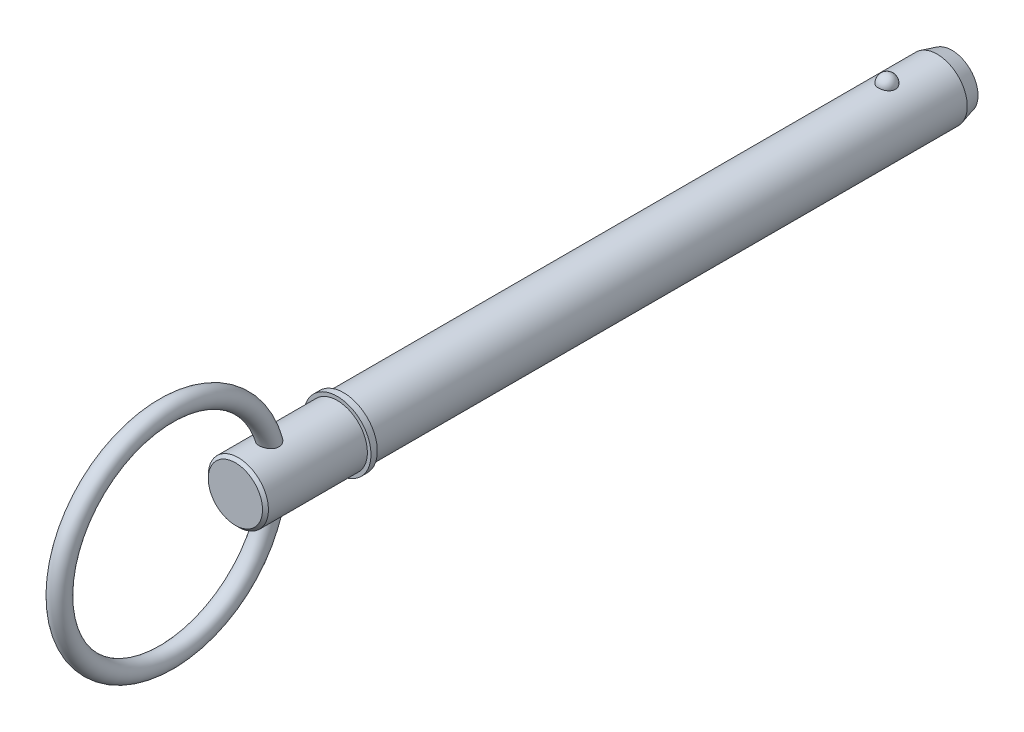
ISO-10303-21;
HEADER;
FILE_DESCRIPTION(('STEP AP214'),'2;1');
FILE_NAME('part.step','',(''),(''),'','','');
FILE_SCHEMA(('AUTOMOTIVE_DESIGN { 1 0 10303 214 1 1 1 1 }'));
ENDSEC;
DATA;
#1=APPLICATION_CONTEXT('core data for automotive mechanical design processes');
#2=APPLICATION_PROTOCOL_DEFINITION('international standard','automotive_design',2000,#1);
#3=PRODUCT_CONTEXT('',#1,'mechanical');
#4=PRODUCT('Part','Part','',(#3));
#5=PRODUCT_RELATED_PRODUCT_CATEGORY('part','',(#4));
#6=PRODUCT_DEFINITION_FORMATION('','',#4);
#7=PRODUCT_DEFINITION_CONTEXT('part definition',#1,'design');
#8=PRODUCT_DEFINITION('design','',#6,#7);
#9=PRODUCT_DEFINITION_SHAPE('','',#8);
#10=(LENGTH_UNIT() NAMED_UNIT(*) SI_UNIT(.MILLI.,.METRE.));
#11=(NAMED_UNIT(*) PLANE_ANGLE_UNIT() SI_UNIT($,.RADIAN.));
#12=(NAMED_UNIT(*) SI_UNIT($,.STERADIAN.) SOLID_ANGLE_UNIT());
#13=UNCERTAINTY_MEASURE_WITH_UNIT(LENGTH_MEASURE(1.E-05),#10,'distance_accuracy_value','');
#14=(GEOMETRIC_REPRESENTATION_CONTEXT(3) GLOBAL_UNCERTAINTY_ASSIGNED_CONTEXT((#13)) GLOBAL_UNIT_ASSIGNED_CONTEXT((#10,
#11,#12)) REPRESENTATION_CONTEXT('',''));
#15=CARTESIAN_POINT('',(0.,0.,0.));
#16=DIRECTION('',(0.,0.,1.));
#17=DIRECTION('',(1.,0.,0.));
#18=AXIS2_PLACEMENT_3D('',#15,#16,#17);
#19=CARTESIAN_POINT('',(0.,0.,127.));
#20=DIRECTION('',(0.,0.,-1.));
#21=DIRECTION('',(-1.,0.,0.));
#22=AXIS2_PLACEMENT_3D('',#19,#20,#21);
#23=CYLINDRICAL_SURFACE('',#22,7.145);
#24=CARTESIAN_POINT('',(1.99971637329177,6.85945766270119,-2.01999999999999));
#25=CARTESIAN_POINT('',(1.9997145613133,6.85945924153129,-1.90709736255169));
#26=CARTESIAN_POINT('',(1.99051486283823,6.86216053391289,-1.79417185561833));
#27=CARTESIAN_POINT('',(1.95393597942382,6.87266409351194,-1.57152267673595));
#28=CARTESIAN_POINT('',(1.92655029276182,6.88046818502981,-1.46180016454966));
#29=CARTESIAN_POINT('',(1.85429435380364,6.90029063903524,-1.24873107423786));
#30=CARTESIAN_POINT('',(1.80943177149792,6.91230715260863,-1.14538172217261));
#31=CARTESIAN_POINT('',(1.70333474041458,6.93921158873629,-0.947875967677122));
#32=CARTESIAN_POINT('',(1.64210059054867,6.95409945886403,-0.85371939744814));
#33=CARTESIAN_POINT('',(1.5044381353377,6.98517577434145,-0.676721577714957));
#34=CARTESIAN_POINT('',(1.42793505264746,7.00137037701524,-0.593939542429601));
#35=CARTESIAN_POINT('',(1.26189697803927,7.03319066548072,-0.442536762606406));
#36=CARTESIAN_POINT('',(1.17236198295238,7.04881635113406,-0.373916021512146));
#37=CARTESIAN_POINT('',(0.982932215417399,7.0777121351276,-0.252935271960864));
#38=CARTESIAN_POINT('',(0.883068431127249,7.09098897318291,-0.200528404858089));
#39=CARTESIAN_POINT('',(0.675560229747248,7.11375589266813,-0.113212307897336));
#40=CARTESIAN_POINT('',(0.567916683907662,7.12324639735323,-0.0783011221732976));
#41=CARTESIAN_POINT('',(0.350006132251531,7.13724173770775,-0.0274707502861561));
#42=CARTESIAN_POINT('',(0.239822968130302,7.14183447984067,-0.011216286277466));
#43=CARTESIAN_POINT('',(0.0181946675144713,7.14583597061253,0.00296794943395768));
#44=CARTESIAN_POINT('',(-0.0932503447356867,7.14524522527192,0.000899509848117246));
#45=CARTESIAN_POINT('',(-0.312527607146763,7.13899247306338,-0.0213331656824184));
#46=CARTESIAN_POINT('',(-0.420388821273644,7.13340426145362,-0.0412340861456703));
#47=CARTESIAN_POINT('',(-0.631141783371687,7.11785474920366,-0.0982040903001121));
#48=CARTESIAN_POINT('',(-0.734033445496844,7.10789337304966,-0.135273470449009));
#49=CARTESIAN_POINT('',(-0.932634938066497,7.08458058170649,-0.225826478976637));
#50=CARTESIAN_POINT('',(-1.02829911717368,7.07120963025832,-0.279405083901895));
#51=CARTESIAN_POINT('',(-1.20927180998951,7.04252043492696,-0.40145733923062));
#52=CARTESIAN_POINT('',(-1.29457925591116,7.02720199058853,-0.469932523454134));
#53=CARTESIAN_POINT('',(-1.45423311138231,6.995926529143,-0.6214381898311));
#54=CARTESIAN_POINT('',(-1.5283348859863,6.97996288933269,-0.704725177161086));
#55=CARTESIAN_POINT('',(-1.66169281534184,6.94942414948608,-0.882667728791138));
#56=CARTESIAN_POINT('',(-1.72094789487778,6.93484915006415,-0.977324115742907));
#57=CARTESIAN_POINT('',(-1.82375276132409,6.90853186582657,-1.17661373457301));
#58=CARTESIAN_POINT('',(-1.86711024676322,6.8968248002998,-1.28135093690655));
#59=CARTESIAN_POINT('',(-1.9360425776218,6.87779420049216,-1.49689986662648));
#60=CARTESIAN_POINT('',(-1.96161794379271,6.87047053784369,-1.60771141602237));
#61=CARTESIAN_POINT('',(-1.99427437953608,6.86106309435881,-1.83176258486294));
#62=CARTESIAN_POINT('',(-2.00143373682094,6.8589571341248,-1.94498985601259));
#63=CARTESIAN_POINT('',(-1.99730449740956,6.86016064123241,-2.17107603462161));
#64=CARTESIAN_POINT('',(-1.98601641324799,6.86346995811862,-2.28393495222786));
#65=CARTESIAN_POINT('',(-1.94538181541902,6.87509649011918,-2.50548437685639));
#66=CARTESIAN_POINT('',(-1.91612773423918,6.88338806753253,-2.61419321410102));
#67=CARTESIAN_POINT('',(-1.84036449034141,6.90402888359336,-2.82501243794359));
#68=CARTESIAN_POINT('',(-1.79385462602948,6.91637828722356,-2.92712255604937));
#69=CARTESIAN_POINT('',(-1.68442067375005,6.94384180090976,-3.12247704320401));
#70=CARTESIAN_POINT('',(-1.62140729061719,6.95897081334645,-3.21566929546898));
#71=CARTESIAN_POINT('',(-1.4806650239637,6.99026742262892,-3.38999412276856));
#72=CARTESIAN_POINT('',(-1.40293556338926,7.00643506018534,-3.47112622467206));
#73=CARTESIAN_POINT('',(-1.2344320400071,7.03807960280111,-3.61938672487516));
#74=CARTESIAN_POINT('',(-1.1436092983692,7.05355363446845,-3.68646046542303));
#75=CARTESIAN_POINT('',(-0.9515914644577,7.08201263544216,-3.80431973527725));
#76=CARTESIAN_POINT('',(-0.850397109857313,7.09499778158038,-3.85510642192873));
#77=CARTESIAN_POINT('',(-0.641823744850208,7.11687679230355,-3.93839532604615));
#78=CARTESIAN_POINT('',(-0.534539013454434,7.1258202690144,-3.97112042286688));
#79=CARTESIAN_POINT('',(-0.315743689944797,7.1388605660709,-4.01830716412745));
#80=CARTESIAN_POINT('',(-0.204233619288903,7.14295798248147,-4.03277105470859));
#81=CARTESIAN_POINT('',(0.0175518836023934,7.14582273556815,-4.04291389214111));
#82=CARTESIAN_POINT('',(0.127809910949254,7.14469090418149,-4.03894819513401));
#83=CARTESIAN_POINT('',(0.346044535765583,7.13745046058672,-4.01315850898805));
#84=CARTESIAN_POINT('',(0.454021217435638,7.13134203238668,-3.99133518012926));
#85=CARTESIAN_POINT('',(0.664227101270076,7.11483713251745,-3.93057164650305));
#86=CARTESIAN_POINT('',(0.766477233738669,7.10445761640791,-3.89169908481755));
#87=CARTESIAN_POINT('',(0.96292921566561,7.08050813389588,-3.79792023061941));
#88=CARTESIAN_POINT('',(1.05713054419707,7.06693796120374,-3.74301290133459));
#89=CARTESIAN_POINT('',(1.23644031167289,7.03780007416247,-3.61765173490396));
#90=CARTESIAN_POINT('',(1.32138387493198,7.0222044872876,-3.5469686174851));
#91=CARTESIAN_POINT('',(1.47830582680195,6.99085504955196,-3.39245228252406));
#92=CARTESIAN_POINT('',(1.55028198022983,6.97510117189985,-3.30861680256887));
#93=CARTESIAN_POINT('',(1.68063701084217,6.94485803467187,-3.12843058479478));
#94=CARTESIAN_POINT('',(1.73875175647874,6.93039619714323,-3.03188405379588));
#95=CARTESIAN_POINT('',(1.83823393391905,6.90467783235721,-2.83015210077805));
#96=CARTESIAN_POINT('',(1.87960712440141,6.89342020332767,-2.72496966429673));
#97=CARTESIAN_POINT('',(1.94111647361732,6.87633596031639,-2.5205023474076));
#98=CARTESIAN_POINT('',(1.96305249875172,6.87005682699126,-2.4217922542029));
#99=CARTESIAN_POINT('',(1.99235308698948,6.86161702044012,-2.22206084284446));
#100=CARTESIAN_POINT('',(1.99971799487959,6.85945624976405,-2.12103957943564));
#101=CARTESIAN_POINT('',(1.99971637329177,6.85945766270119,-2.01999999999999));
#102=B_SPLINE_CURVE_WITH_KNOTS('',3,(#24,#25,#26,#27,#28,#29,#30,#31,#32,#33,#34,#35,#36,#37,
#38,#39,#40,#41,#42,#43,#44,#45,#46,#47,#48,#49,#50,#51,#52,#53,#54,#55,#56,#57,#58,#59,#60,#61,
#62,#63,#64,#65,#66,#67,#68,#69,#70,#71,#72,#73,#74,#75,#76,#77,#78,#79,#80,#81,#82,#83,#84,#85,
#86,#87,#88,#89,#90,#91,#92,#93,#94,#95,#96,#97,#98,#99,#100,#101),.UNSPECIFIED.,.T.,.F.,(4,2,2,
2,2,2,2,2,2,2,2,2,2,2,2,2,2,2,2,2,2,2,2,2,2,2,2,2,2,2,2,2,2,2,2,2,2,2,4),(0.,0.338345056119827,
0.67681114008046,1.01512885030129,1.35344038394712,1.69345130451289,2.0334623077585,
2.37248128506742,2.71146235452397,3.04425125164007,3.37700766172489,3.70493009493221,
4.03285819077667,4.36270921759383,4.69259422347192,5.02887632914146,5.36518278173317,
5.70543263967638,6.04567253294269,6.38446363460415,6.72324532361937,7.0602984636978,
7.39736530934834,7.73629500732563,8.07523799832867,8.4154752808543,8.7556883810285,
9.09160363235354,9.42747756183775,9.75690239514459,10.0863150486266,10.4144324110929,
10.7425709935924,11.0758313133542,11.4091490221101,11.748385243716,12.0875046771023,
12.3903058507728,12.6930998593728),.UNSPECIFIED.);
#103=CARTESIAN_POINT('',(1.99971637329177,6.85945766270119,-2.01999999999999));
#104=VERTEX_POINT('',#103);
#105=EDGE_CURVE('E103',#104,#104,#102,.T.);
#106=ORIENTED_EDGE('',*,*,#105,.T.);
#107=EDGE_LOOP('',(#106));
#108=FACE_BOUND('',#107,.T.);
#109=CARTESIAN_POINT('',(0.,0.,-13.9499999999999));
#110=DIRECTION('',(0.,0.,-1.));
#111=DIRECTION('',(-1.,0.,0.));
#112=AXIS2_PLACEMENT_3D('',#109,#110,#111);
#113=CIRCLE('',#112,7.145);
#114=CARTESIAN_POINT('',(-7.145,0.,-13.9499999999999));
#115=VERTEX_POINT('',#114);
#116=EDGE_CURVE('E111',#115,#115,#113,.F.);
#117=ORIENTED_EDGE('',*,*,#116,.T.);
#118=EDGE_LOOP('',(#117));
#119=FACE_BOUND('',#118,.T.);
#120=CARTESIAN_POINT('',(0.,0.,127.));
#121=DIRECTION('',(0.,0.,1.));
#122=DIRECTION('',(1.,0.,0.));
#123=AXIS2_PLACEMENT_3D('',#120,#121,#122);
#124=CIRCLE('',#123,7.145);
#125=CARTESIAN_POINT('',(7.145,0.,127.));
#126=VERTEX_POINT('',#125);
#127=EDGE_CURVE('E109',#126,#126,#124,.T.);
#128=ORIENTED_EDGE('',*,*,#127,.F.);
#129=EDGE_LOOP('',(#128));
#130=FACE_BOUND('',#129,.T.);
#131=ADVANCED_FACE('F39',(#108,#119,#130),#23,.T.);
#132=CARTESIAN_POINT('',(0.,0.,-17.45));
#133=DIRECTION('',(0.,0.,-1.));
#134=DIRECTION('',(-1.,0.,0.));
#135=AXIS2_PLACEMENT_3D('',#132,#133,#134);
#136=PLANE('',#135);
#137=CARTESIAN_POINT('',(0.,0.,-17.45));
#138=DIRECTION('',(0.,0.,-1.));
#139=DIRECTION('',(-1.,0.,0.));
#140=AXIS2_PLACEMENT_3D('',#137,#138,#139);
#141=CIRCLE('',#140,6.20717782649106);
#142=CARTESIAN_POINT('',(-6.20717782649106,0.,-17.45));
#143=VERTEX_POINT('',#142);
#144=EDGE_CURVE('E142',#143,#143,#141,.T.);
#145=ORIENTED_EDGE('',*,*,#144,.T.);
#146=EDGE_LOOP('',(#145));
#147=FACE_BOUND('',#146,.T.);
#148=ADVANCED_FACE('F89',(#147),#136,.T.);
#149=CARTESIAN_POINT('',(0.,0.,-17.45));
#150=DIRECTION('',(0.,0.,1.));
#151=DIRECTION('',(1.,0.,0.));
#152=AXIS2_PLACEMENT_3D('',#149,#150,#151);
#153=CONICAL_SURFACE('',#152,6.20717782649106,0.261799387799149);
#154=ORIENTED_EDGE('',*,*,#116,.F.);
#155=EDGE_LOOP('',(#154));
#156=FACE_BOUND('',#155,.T.);
#157=ORIENTED_EDGE('',*,*,#144,.F.);
#158=EDGE_LOOP('',(#157));
#159=FACE_BOUND('',#158,.T.);
#160=ADVANCED_FACE('F95',(#156,#159),#153,.T.);
#161=CARTESIAN_POINT('',(0.,7.145,-2.01999999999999));
#162=DIRECTION('',(0.,1.,0.));
#163=DIRECTION('',(0.,0.,-1.));
#164=AXIS2_PLACEMENT_3D('',#161,#162,#163);
#165=SPHERICAL_SURFACE('',#164,2.02);
#166=ORIENTED_EDGE('',*,*,#105,.F.);
#167=EDGE_LOOP('',(#166));
#168=FACE_BOUND('',#167,.T.);
#169=ADVANCED_FACE('F114',(#168),#165,.T.);
#170=CARTESIAN_POINT('',(0.,0.,127.));
#171=DIRECTION('',(0.,0.,-1.));
#172=DIRECTION('',(-1.,0.,0.));
#173=AXIS2_PLACEMENT_3D('',#170,#171,#172);
#174=PLANE('',#173);
#175=ORIENTED_EDGE('',*,*,#127,.T.);
#176=EDGE_LOOP('',(#175));
#177=FACE_BOUND('',#176,.T.);
#178=CARTESIAN_POINT('',(0.,0.,127.));
#179=DIRECTION('',(0.,0.,-1.));
#180=DIRECTION('',(-1.,0.,0.));
#181=AXIS2_PLACEMENT_3D('',#178,#179,#180);
#182=CIRCLE('',#181,8.);
#183=CARTESIAN_POINT('',(-8.,0.,127.));
#184=VERTEX_POINT('',#183);
#185=EDGE_CURVE('E110',#184,#184,#182,.T.);
#186=ORIENTED_EDGE('',*,*,#185,.T.);
#187=EDGE_LOOP('',(#186));
#188=FACE_BOUND('',#187,.T.);
#189=ADVANCED_FACE('F118',(#177,#188),#174,.T.);
#190=CARTESIAN_POINT('',(0.,0.,33.7287874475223));
#191=DIRECTION('',(0.,0.,-1.));
#192=DIRECTION('',(-1.,0.,0.));
#193=AXIS2_PLACEMENT_3D('',#190,#191,#192);
#194=CYLINDRICAL_SURFACE('',#193,8.);
#195=CARTESIAN_POINT('',(0.,0.,128.5));
#196=DIRECTION('',(0.,0.,-1.));
#197=DIRECTION('',(-1.,0.,0.));
#198=AXIS2_PLACEMENT_3D('',#195,#196,#197);
#199=CIRCLE('',#198,8.);
#200=CARTESIAN_POINT('',(-8.,0.,128.5));
#201=VERTEX_POINT('',#200);
#202=EDGE_CURVE('E135',#201,#201,#199,.T.);
#203=ORIENTED_EDGE('',*,*,#202,.T.);
#204=EDGE_LOOP('',(#203));
#205=FACE_BOUND('',#204,.T.);
#206=ORIENTED_EDGE('',*,*,#185,.F.);
#207=EDGE_LOOP('',(#206));
#208=FACE_BOUND('',#207,.T.);
#209=ADVANCED_FACE('F122',(#205,#208),#194,.T.);
#210=CARTESIAN_POINT('',(0.,8.,128.5));
#211=DIRECTION('',(0.,0.,1.));
#212=DIRECTION('',(1.,0.,0.));
#213=AXIS2_PLACEMENT_3D('',#210,#211,#212);
#214=PLANE('',#213);
#215=CARTESIAN_POINT('',(0.,0.,128.5));
#216=DIRECTION('',(0.,0.,1.));
#217=DIRECTION('',(1.,0.,0.));
#218=AXIS2_PLACEMENT_3D('',#215,#216,#217);
#219=CIRCLE('',#218,7.145);
#220=CARTESIAN_POINT('',(7.145,0.,128.5));
#221=VERTEX_POINT('',#220);
#222=EDGE_CURVE('E113',#221,#221,#219,.T.);
#223=ORIENTED_EDGE('',*,*,#222,.F.);
#224=EDGE_LOOP('',(#223));
#225=FACE_BOUND('',#224,.T.);
#226=ORIENTED_EDGE('',*,*,#202,.F.);
#227=EDGE_LOOP('',(#226));
#228=FACE_BOUND('',#227,.T.);
#229=ADVANCED_FACE('F86',(#225,#228),#214,.T.);
#230=CARTESIAN_POINT('',(0.,0.,152.7));
#231=DIRECTION('',(0.,0.,-1.));
#232=DIRECTION('',(-1.,0.,0.));
#233=AXIS2_PLACEMENT_3D('',#230,#231,#232);
#234=CYLINDRICAL_SURFACE('',#233,7.145);
#235=CARTESIAN_POINT('',(-1.03551034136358,-7.0695645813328,142.630259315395));
#236=CARTESIAN_POINT('',(-0.923225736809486,-7.08601142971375,142.574402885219));
#237=CARTESIAN_POINT('',(-0.806039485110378,-7.10042113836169,142.527835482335));
#238=CARTESIAN_POINT('',(-0.565173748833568,-7.1236385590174,142.454279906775));
#239=CARTESIAN_POINT('',(-0.441495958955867,-7.13244772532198,142.427286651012));
#240=CARTESIAN_POINT('',(-0.191106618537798,-7.14354309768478,142.393450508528));
#241=CARTESIAN_POINT('',(-0.0643945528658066,-7.14582818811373,142.386611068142));
#242=CARTESIAN_POINT('',(0.18844338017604,-7.14363337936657,142.393241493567));
#243=CARTESIAN_POINT('',(0.314569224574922,-7.13915321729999,142.406712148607));
#244=CARTESIAN_POINT('',(0.562499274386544,-7.12390574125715,142.45364165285));
#245=CARTESIAN_POINT('',(0.684308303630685,-7.11314569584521,142.487077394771));
#246=CARTESIAN_POINT('',(0.920329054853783,-7.08647538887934,142.573194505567));
#247=CARTESIAN_POINT('',(1.0345403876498,-7.07056486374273,142.625876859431));
#248=CARTESIAN_POINT('',(1.2523263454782,-7.03526161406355,142.7494470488));
#249=CARTESIAN_POINT('',(1.35588248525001,-7.01586299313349,142.82036580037));
#250=CARTESIAN_POINT('',(1.54916093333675,-6.9757352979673,142.978757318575));
#251=CARTESIAN_POINT('',(1.63888414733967,-6.95500631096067,143.066229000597));
#252=CARTESIAN_POINT('',(1.80113983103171,-6.91475703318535,143.254727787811));
#253=CARTESIAN_POINT('',(1.87381924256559,-6.89522757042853,143.355626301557));
#254=CARTESIAN_POINT('',(2.00091178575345,-6.8594283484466,143.56884010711));
#255=CARTESIAN_POINT('',(2.05532963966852,-6.8431577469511,143.681152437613));
#256=CARTESIAN_POINT('',(2.14350100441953,-6.81604873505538,143.911194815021));
#257=CARTESIAN_POINT('',(2.17770329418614,-6.80509340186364,144.028739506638));
#258=CARTESIAN_POINT('',(2.22691394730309,-6.7891497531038,144.268149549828));
#259=CARTESIAN_POINT('',(2.2419216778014,-6.7841616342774,144.390015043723));
#260=CARTESIAN_POINT('',(2.25313992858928,-6.78044381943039,144.63580699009));
#261=CARTESIAN_POINT('',(2.24917302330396,-6.78177319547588,144.759742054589));
#262=CARTESIAN_POINT('',(2.22301329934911,-6.79039131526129,145.005438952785));
#263=CARTESIAN_POINT('',(2.20081491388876,-6.79768187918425,145.1272001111));
#264=CARTESIAN_POINT('',(2.13702421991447,-6.81801706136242,145.375287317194));
#265=CARTESIAN_POINT('',(2.09404815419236,-6.83146790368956,145.501223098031));
#266=CARTESIAN_POINT('',(1.98986384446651,-6.86253672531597,145.744824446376));
#267=CARTESIAN_POINT('',(1.92864130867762,-6.88015796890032,145.862483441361));
#268=CARTESIAN_POINT('',(1.7827436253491,-6.91947130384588,146.097497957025));
#269=CARTESIAN_POINT('',(1.6964070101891,-6.94139021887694,146.213789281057));
#270=CARTESIAN_POINT('',(1.50503944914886,-6.98537683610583,146.429799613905));
#271=CARTESIAN_POINT('',(1.40001969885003,-7.00744444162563,146.529528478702));
#272=CARTESIAN_POINT('',(1.19221781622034,-7.04548349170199,146.693170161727));
#273=CARTESIAN_POINT('',(1.09203347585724,-7.06185586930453,146.76028599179));
#274=CARTESIAN_POINT('',(0.88160718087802,-7.09119477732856,146.877337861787));
#275=CARTESIAN_POINT('',(0.771372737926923,-7.10416382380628,146.927286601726));
#276=CARTESIAN_POINT('',(0.542622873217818,-7.12529560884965,147.007475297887));
#277=CARTESIAN_POINT('',(0.424058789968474,-7.13342692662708,147.03758654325));
#278=CARTESIAN_POINT('',(0.183155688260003,-7.14366628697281,147.075370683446));
#279=CARTESIAN_POINT('',(0.0608191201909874,-7.14577815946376,147.083057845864));
#280=CARTESIAN_POINT('',(-0.169367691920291,-7.14381572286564,147.075860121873));
#281=CARTESIAN_POINT('',(-0.277308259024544,-7.14040669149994,147.063402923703));
#282=CARTESIAN_POINT('',(-0.489468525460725,-7.12900651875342,147.021156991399));
#283=CARTESIAN_POINT('',(-0.593687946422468,-7.12101503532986,146.991366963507));
#284=CARTESIAN_POINT('',(-0.796149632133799,-7.10123695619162,146.915987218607));
#285=CARTESIAN_POINT('',(-0.894373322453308,-7.08943921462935,146.870351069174));
#286=CARTESIAN_POINT('',(-1.08274371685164,-7.06312621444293,146.765336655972));
#287=CARTESIAN_POINT('',(-1.17288754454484,-7.04860999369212,146.705953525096));
#288=CARTESIAN_POINT('',(-1.35484961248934,-7.01605385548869,146.567113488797));
#289=CARTESIAN_POINT('',(-1.44541008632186,-6.99780069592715,146.486061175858));
#290=CARTESIAN_POINT('',(-1.61364655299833,-6.96093393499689,146.311599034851));
#291=CARTESIAN_POINT('',(-1.69131381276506,-6.94232009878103,146.218180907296));
#292=CARTESIAN_POINT('',(-1.84330074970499,-6.90364386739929,146.006608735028));
#293=CARTESIAN_POINT('',(-1.91543090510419,-6.88377370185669,145.886839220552));
#294=CARTESIAN_POINT('',(-2.04002946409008,-6.84788436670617,145.636875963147));
#295=CARTESIAN_POINT('',(-2.09248830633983,-6.83186707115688,145.506677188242));
#296=CARTESIAN_POINT('',(-2.17795964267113,-6.80511869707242,145.232555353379));
#297=CARTESIAN_POINT('',(-2.20992909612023,-6.79467512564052,145.088274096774));
#298=CARTESIAN_POINT('',(-2.24813111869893,-6.78213595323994,144.795984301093));
#299=CARTESIAN_POINT('',(-2.25438316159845,-6.78003403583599,144.647978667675));
#300=CARTESIAN_POINT('',(-2.24011368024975,-6.78475868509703,144.365430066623));
#301=CARTESIAN_POINT('',(-2.22172362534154,-6.79087455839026,144.230769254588));
#302=CARTESIAN_POINT('',(-2.16145328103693,-6.81029672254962,143.967367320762));
#303=CARTESIAN_POINT('',(-2.11958615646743,-6.82359898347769,143.838622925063));
#304=CARTESIAN_POINT('',(-2.01784121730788,-6.85433303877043,143.602267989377));
#305=CARTESIAN_POINT('',(-1.9598239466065,-6.8713108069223,143.493792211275));
#306=CARTESIAN_POINT('',(-1.82642155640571,-6.90796511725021,143.288591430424));
#307=CARTESIAN_POINT('',(-1.75103235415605,-6.92764229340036,143.191869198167));
#308=CARTESIAN_POINT('',(-1.57825515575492,-6.96911949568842,143.005408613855));
#309=CARTESIAN_POINT('',(-1.47957996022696,-6.9909623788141,142.91687037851));
#310=CARTESIAN_POINT('',(-1.26760341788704,-7.0324852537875,142.758840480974));
#311=CARTESIAN_POINT('',(-1.15429989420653,-7.05216492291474,142.689351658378));
#312=CARTESIAN_POINT('',(-1.03551034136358,-7.0695645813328,142.630259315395));
#313=B_SPLINE_CURVE_WITH_KNOTS('',3,(#235,#236,#237,#238,#239,#240,#241,#242,#243,#244,#245,
#246,#247,#248,#249,#250,#251,#252,#253,#254,#255,#256,#257,#258,#259,#260,#261,#262,#263,#264,
#265,#266,#267,#268,#269,#270,#271,#272,#273,#274,#275,#276,#277,#278,#279,#280,#281,#282,#283,
#284,#285,#286,#287,#288,#289,#290,#291,#292,#293,#294,#295,#296,#297,#298,#299,#300,#301,#302,
#303,#304,#305,#306,#307,#308,#309,#310,#311,#312),.UNSPECIFIED.,.T.,.F.,(4,2,2,2,2,2,2,2,2,2,2,
2,2,2,2,2,2,2,2,2,2,2,2,2,2,2,2,2,2,2,2,2,2,2,2,2,2,2,4),(0.,0.378979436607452,
0.757860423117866,1.13680619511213,1.51576669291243,1.89428943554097,2.27283155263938,
2.65201969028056,3.03118299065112,3.40694616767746,3.78261210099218,4.14959041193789,
4.51658082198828,4.88700951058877,5.25755134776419,5.65713708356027,6.05703662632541,
6.49445595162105,6.93161403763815,7.29520224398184,7.65852089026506,8.02417421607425,
8.38959483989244,8.71415763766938,9.03874466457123,9.36429093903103,9.68995264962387,
10.0572255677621,10.4247462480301,10.8465602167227,11.2685789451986,11.7106604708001,
12.152407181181,12.5583067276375,12.9639788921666,13.3347314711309,13.7055712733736,
14.1064462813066,14.5073810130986),.UNSPECIFIED.);
#314=CARTESIAN_POINT('',(-1.03551034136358,-7.0695645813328,142.630259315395));
#315=VERTEX_POINT('',#314);
#316=EDGE_CURVE('E10',#315,#315,#313,.T.);
#317=ORIENTED_EDGE('',*,*,#316,.F.);
#318=EDGE_LOOP('',(#317));
#319=FACE_BOUND('',#318,.T.);
#320=CARTESIAN_POINT('',(-1.03551034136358,7.0695645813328,142.630259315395));
#321=CARTESIAN_POINT('',(-1.14644953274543,7.05331457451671,142.685446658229));
#322=CARTESIAN_POINT('',(-1.25260902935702,7.03507806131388,142.749702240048));
#323=CARTESIAN_POINT('',(-1.45240021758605,6.99656564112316,142.894958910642));
#324=CARTESIAN_POINT('',(-1.54602879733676,6.97628922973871,142.975964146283));
#325=CARTESIAN_POINT('',(-1.71815091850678,6.93590796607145,143.152910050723));
#326=CARTESIAN_POINT('',(-1.79663177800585,6.91580327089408,143.248863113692));
#327=CARTESIAN_POINT('',(-1.9360771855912,6.87807159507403,143.453162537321));
#328=CARTESIAN_POINT('',(-1.99704642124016,6.86044395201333,143.561505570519));
#329=CARTESIAN_POINT('',(-2.09894945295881,6.82995115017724,143.785542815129));
#330=CARTESIAN_POINT('',(-2.1402125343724,6.81700866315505,143.901076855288));
#331=CARTESIAN_POINT('',(-2.20347311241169,6.79682602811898,144.137758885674));
#332=CARTESIAN_POINT('',(-2.22547114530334,6.78958572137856,144.258906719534));
#333=CARTESIAN_POINT('',(-2.25026114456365,6.78140983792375,144.503214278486));
#334=CARTESIAN_POINT('',(-2.25306986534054,6.78046876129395,144.62637215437));
#335=CARTESIAN_POINT('',(-2.2403056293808,6.78469532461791,144.871604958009));
#336=CARTESIAN_POINT('',(-2.22472720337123,6.78986478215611,144.993679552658));
#337=CARTESIAN_POINT('',(-2.17472134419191,6.8060520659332,145.242036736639));
#338=CARTESIAN_POINT('',(-2.13910164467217,6.81743831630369,145.368053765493));
#339=CARTESIAN_POINT('',(-2.04975058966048,6.84483151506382,145.612973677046));
#340=CARTESIAN_POINT('',(-1.99600968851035,6.86084089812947,145.731872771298));
#341=CARTESIAN_POINT('',(-1.86558545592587,6.8975101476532,145.971425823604));
#342=CARTESIAN_POINT('',(-1.78715729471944,6.91847353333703,146.091087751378));
#343=CARTESIAN_POINT('',(-1.61149373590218,6.96148580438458,146.315646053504));
#344=CARTESIAN_POINT('',(-1.51424701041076,6.98353533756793,146.42053346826));
#345=CARTESIAN_POINT('',(-1.30107590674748,7.02639179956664,146.612951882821));
#346=CARTESIAN_POINT('',(-1.18492282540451,7.04717858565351,146.700236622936));
#347=CARTESIAN_POINT('',(-0.937392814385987,7.08434208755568,146.850827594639));
#348=CARTESIAN_POINT('',(-0.806039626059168,7.10072555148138,146.914170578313));
#349=CARTESIAN_POINT('',(-0.550470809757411,7.12475629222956,147.005483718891));
#350=CARTESIAN_POINT('',(-0.427643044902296,7.13327781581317,147.037047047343));
#351=CARTESIAN_POINT('',(-0.240556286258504,7.14122488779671,147.066356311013));
#352=CARTESIAN_POINT('',(-0.177714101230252,7.14306799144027,147.073119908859));
#353=CARTESIAN_POINT('',(-0.051647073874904,7.14509121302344,147.080539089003));
#354=CARTESIAN_POINT('',(0.0115777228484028,7.14527152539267,147.081195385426));
#355=CARTESIAN_POINT('',(0.182932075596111,7.14347436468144,147.074616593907));
#356=CARTESIAN_POINT('',(0.290871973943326,7.13986325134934,147.061408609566));
#357=CARTESIAN_POINT('',(0.502842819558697,7.1280769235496,147.017690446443));
#358=CARTESIAN_POINT('',(0.606873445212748,7.11990133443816,146.987178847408));
#359=CARTESIAN_POINT('',(0.809001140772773,7.09978218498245,146.910378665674));
#360=CARTESIAN_POINT('',(0.907071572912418,7.08782300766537,146.864024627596));
#361=CARTESIAN_POINT('',(1.09503957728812,7.0612282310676,146.757620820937));
#362=CARTESIAN_POINT('',(1.18493426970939,7.04659169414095,146.697566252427));
#363=CARTESIAN_POINT('',(1.36644041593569,7.01380352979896,146.557233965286));
#364=CARTESIAN_POINT('',(1.45676563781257,6.99544216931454,146.475344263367));
#365=CARTESIAN_POINT('',(1.62440639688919,6.95842750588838,146.299231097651));
#366=CARTESIAN_POINT('',(1.701712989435,6.93977401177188,146.204999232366));
#367=CARTESIAN_POINT('',(1.85271606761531,6.90111647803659,145.991807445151));
#368=CARTESIAN_POINT('',(1.92421731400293,6.88131605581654,145.871248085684));
#369=CARTESIAN_POINT('',(2.04739198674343,6.84567995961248,145.619785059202));
#370=CARTESIAN_POINT('',(2.09905621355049,6.82984612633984,145.488876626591));
#371=CARTESIAN_POINT('',(2.18257767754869,6.80363167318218,145.213847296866));
#372=CARTESIAN_POINT('',(2.21345394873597,6.79352430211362,145.069397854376));
#373=CARTESIAN_POINT('',(2.24941288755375,6.78170753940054,144.776984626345));
#374=CARTESIAN_POINT('',(2.2545156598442,6.77999160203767,144.629023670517));
#375=CARTESIAN_POINT('',(2.2380435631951,6.78544298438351,144.347053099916));
#376=CARTESIAN_POINT('',(2.21864521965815,6.79188566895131,144.212903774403));
#377=CARTESIAN_POINT('',(2.1564876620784,6.81187529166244,143.950690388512));
#378=CARTESIAN_POINT('',(2.11373989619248,6.82541874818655,143.82262337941));
#379=CARTESIAN_POINT('',(2.01040099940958,6.85652522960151,143.587507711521));
#380=CARTESIAN_POINT('',(1.95162600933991,6.87365110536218,143.479597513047));
#381=CARTESIAN_POINT('',(1.81683142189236,6.91050025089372,143.275649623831));
#382=CARTESIAN_POINT('',(1.74081238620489,6.93022343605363,143.179611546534));
#383=CARTESIAN_POINT('',(1.57431234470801,6.96992220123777,143.00254183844));
#384=CARTESIAN_POINT('',(1.48394688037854,6.98989467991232,142.921400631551));
#385=CARTESIAN_POINT('',(1.29081365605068,7.02812243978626,142.775038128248));
#386=CARTESIAN_POINT('',(1.18804491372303,7.04637758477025,142.709818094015));
#387=CARTESIAN_POINT('',(0.970386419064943,7.07967210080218,142.595377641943));
#388=CARTESIAN_POINT('',(0.855272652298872,7.09462807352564,142.546558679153));
#389=CARTESIAN_POINT('',(0.618143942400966,7.11920826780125,142.468071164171));
#390=CARTESIAN_POINT('',(0.496128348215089,7.12883198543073,142.438404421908));
#391=CARTESIAN_POINT('',(0.247581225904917,7.14180209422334,142.398698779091));
#392=CARTESIAN_POINT('',(0.121020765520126,7.14509609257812,142.388823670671));
#393=CARTESIAN_POINT('',(-0.132022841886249,7.14489967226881,142.389415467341));
#394=CARTESIAN_POINT('',(-0.2585060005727,7.14141109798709,142.399876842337));
#395=CARTESIAN_POINT('',(-0.496649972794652,7.12862600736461,142.439053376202));
#396=CARTESIAN_POINT('',(-0.608625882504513,7.11987587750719,142.466055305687));
#397=CARTESIAN_POINT('',(-0.826925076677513,7.09783467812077,142.536222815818));
#398=CARTESIAN_POINT('',(-0.933248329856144,7.08454358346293,142.579388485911));
#399=CARTESIAN_POINT('',(-1.03551034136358,7.0695645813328,142.630259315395));
#400=B_SPLINE_CURVE_WITH_KNOTS('',3,(#320,#321,#322,#323,#324,#325,#326,#327,#328,#329,#330,
#331,#332,#333,#334,#335,#336,#337,#338,#339,#340,#341,#342,#343,#344,#345,#346,#347,#348,#349,
#350,#351,#352,#353,#354,#355,#356,#357,#358,#359,#360,#361,#362,#363,#364,#365,#366,#367,#368,
#369,#370,#371,#372,#373,#374,#375,#376,#377,#378,#379,#380,#381,#382,#383,#384,#385,#386,#387,
#388,#389,#390,#391,#392,#393,#394,#395,#396,#397,#398,#399),.UNSPECIFIED.,.T.,.F.,(4,2,2,2,2,2,
2,2,2,2,2,2,2,2,2,2,2,2,2,2,2,2,2,2,2,2,2,2,2,2,2,2,2,2,2,2,2,2,2,4),(0.,0.374504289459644,
0.7491014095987,1.12401080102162,1.49881974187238,1.86712525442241,2.23542051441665,
2.60339417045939,2.97147730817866,3.36420696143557,3.75714381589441,4.18898920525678,
4.62109535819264,5.0588812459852,5.49599234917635,5.87475353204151,6.06416800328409,
6.25356032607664,6.57826179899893,6.90298992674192,7.22907626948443,7.55527703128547,
7.92373585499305,8.29244681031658,8.71527472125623,9.13829848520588,9.58009907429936,
10.0215549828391,10.4264139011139,10.831074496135,11.2014904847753,11.571894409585,
11.9394538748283,12.3070424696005,12.6830655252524,13.0591241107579,13.4382822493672,
13.8173372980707,14.1625475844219,14.5077597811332),.UNSPECIFIED.);
#401=CARTESIAN_POINT('',(-1.03551034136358,7.0695645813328,142.630259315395));
#402=VERTEX_POINT('',#401);
#403=EDGE_CURVE('E51',#402,#402,#400,.T.);
#404=ORIENTED_EDGE('',*,*,#403,.F.);
#405=EDGE_LOOP('',(#404));
#406=FACE_BOUND('',#405,.T.);
#407=CARTESIAN_POINT('',(0.,0.,152.));
#408=DIRECTION('',(0.,0.,-1.));
#409=DIRECTION('',(-1.,0.,0.));
#410=AXIS2_PLACEMENT_3D('',#407,#408,#409);
#411=CIRCLE('',#410,7.145);
#412=CARTESIAN_POINT('',(-7.145,0.,152.));
#413=VERTEX_POINT('',#412);
#414=EDGE_CURVE('E65',#413,#413,#411,.T.);
#415=ORIENTED_EDGE('',*,*,#414,.T.);
#416=EDGE_LOOP('',(#415));
#417=FACE_BOUND('',#416,.T.);
#418=ORIENTED_EDGE('',*,*,#222,.T.);
#419=EDGE_LOOP('',(#418));
#420=FACE_BOUND('',#419,.T.);
#421=ADVANCED_FACE('F70',(#319,#406,#417,#420),#234,.T.);
#422=CARTESIAN_POINT('',(0.,0.,152.7));
#423=DIRECTION('',(0.,0.,-1.));
#424=DIRECTION('',(-1.,0.,0.));
#425=AXIS2_PLACEMENT_3D('',#422,#423,#424);
#426=PLANE('',#425);
#427=CARTESIAN_POINT('',(0.,0.,152.7));
#428=DIRECTION('',(0.,0.,-1.));
#429=DIRECTION('',(-1.,0.,0.));
#430=AXIS2_PLACEMENT_3D('',#427,#428,#429);
#431=CIRCLE('',#430,6.44499999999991);
#432=CARTESIAN_POINT('',(-6.44499999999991,0.,152.7));
#433=VERTEX_POINT('',#432);
#434=EDGE_CURVE('E58',#433,#433,#431,.F.);
#435=ORIENTED_EDGE('',*,*,#434,.T.);
#436=EDGE_LOOP('',(#435));
#437=FACE_BOUND('',#436,.T.);
#438=ADVANCED_FACE('F77',(#437),#426,.F.);
#439=CARTESIAN_POINT('',(0.,0.,152.));
#440=DIRECTION('',(0.,0.,-1.));
#441=DIRECTION('',(-1.,0.,0.));
#442=AXIS2_PLACEMENT_3D('',#439,#440,#441);
#443=CONICAL_SURFACE('',#442,7.145,0.78539816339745);
#444=ORIENTED_EDGE('',*,*,#434,.F.);
#445=EDGE_LOOP('',(#444));
#446=FACE_BOUND('',#445,.T.);
#447=ORIENTED_EDGE('',*,*,#414,.F.);
#448=EDGE_LOOP('',(#447));
#449=FACE_BOUND('',#448,.T.);
#450=ADVANCED_FACE('F41',(#446,#449),#443,.T.);
#451=CARTESIAN_POINT('',(0.,0.,169.1));
#452=DIRECTION('',(1.,0.,0.));
#453=DIRECTION('',(0.,0.,-1.));
#454=AXIS2_PLACEMENT_3D('',#451,#452,#453);
#455=TOROIDAL_SURFACE('',#454,25.4,2.25);
#456=ORIENTED_EDGE('',*,*,#316,.T.);
#457=EDGE_LOOP('',(#456));
#458=FACE_BOUND('',#457,.T.);
#459=ORIENTED_EDGE('',*,*,#403,.T.);
#460=EDGE_LOOP('',(#459));
#461=FACE_BOUND('',#460,.T.);
#462=ADVANCED_FACE('F74',(#458,#461),#455,.T.);
#463=CLOSED_SHELL('',(#131,#148,#160,#169,#189,#209,#229,#421,#438,#450,#462));
#464=MANIFOLD_SOLID_BREP('B2',#463);
#465=ADVANCED_BREP_SHAPE_REPRESENTATION('',(#18,#464),#14);
#466=SHAPE_DEFINITION_REPRESENTATION(#9,#465);
ENDSEC;
END-ISO-10303-21;
